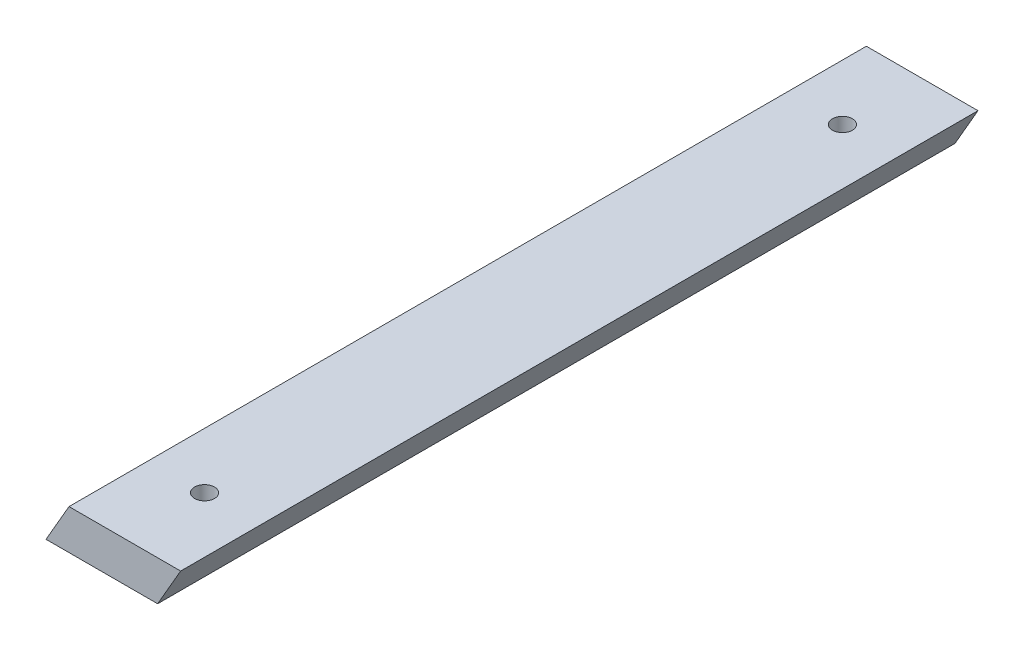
ISO-10303-21;
HEADER;
FILE_DESCRIPTION(('STEP AP214'),'2;1');
FILE_NAME('part.step','',(''),(''),'','','');
FILE_SCHEMA(('AUTOMOTIVE_DESIGN { 1 0 10303 214 1 1 1 1 }'));
ENDSEC;
DATA;
#1=APPLICATION_CONTEXT('core data for automotive mechanical design processes');
#2=APPLICATION_PROTOCOL_DEFINITION('international standard','automotive_design',2000,#1);
#3=PRODUCT_CONTEXT('',#1,'mechanical');
#4=PRODUCT('Part','Part','',(#3));
#5=PRODUCT_RELATED_PRODUCT_CATEGORY('part','',(#4));
#6=PRODUCT_DEFINITION_FORMATION('','',#4);
#7=PRODUCT_DEFINITION_CONTEXT('part definition',#1,'design');
#8=PRODUCT_DEFINITION('design','',#6,#7);
#9=PRODUCT_DEFINITION_SHAPE('','',#8);
#10=(LENGTH_UNIT() NAMED_UNIT(*) SI_UNIT(.MILLI.,.METRE.));
#11=(NAMED_UNIT(*) PLANE_ANGLE_UNIT() SI_UNIT($,.RADIAN.));
#12=(NAMED_UNIT(*) SI_UNIT($,.STERADIAN.) SOLID_ANGLE_UNIT());
#13=UNCERTAINTY_MEASURE_WITH_UNIT(LENGTH_MEASURE(1.E-05),#10,'distance_accuracy_value','');
#14=(GEOMETRIC_REPRESENTATION_CONTEXT(3) GLOBAL_UNCERTAINTY_ASSIGNED_CONTEXT((#13)) GLOBAL_UNIT_ASSIGNED_CONTEXT((#10,
#11,#12)) REPRESENTATION_CONTEXT('',''));
#15=CARTESIAN_POINT('',(0.,0.,0.));
#16=DIRECTION('',(0.,0.,1.));
#17=DIRECTION('',(1.,0.,0.));
#18=AXIS2_PLACEMENT_3D('',#15,#16,#17);
#19=CARTESIAN_POINT('',(0.,-5.,100.));
#20=DIRECTION('',(0.,1.,0.));
#21=DIRECTION('',(0.,0.,1.));
#22=AXIS2_PLACEMENT_3D('',#19,#20,#21);
#23=PLANE('',#22);
#24=DIRECTION('',(1.,0.,0.));
#25=VECTOR('',#24,1.);
#26=CARTESIAN_POINT('',(0.,-5.,-100.));
#27=LINE('',#26,#25);
#28=CARTESIAN_POINT('',(-19.7735026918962,-5.,-100.));
#29=VERTEX_POINT('',#28);
#30=CARTESIAN_POINT('',(8.22649730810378,-5.,-100.));
#31=VERTEX_POINT('',#30);
#32=EDGE_CURVE('E88',#29,#31,#27,.T.);
#33=ORIENTED_EDGE('',*,*,#32,.T.);
#34=DIRECTION('',(0.,0.,-1.));
#35=VECTOR('',#34,1.);
#36=CARTESIAN_POINT('',(8.22649730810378,-5.,100.));
#37=LINE('',#36,#35);
#38=CARTESIAN_POINT('',(8.22649730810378,-5.,100.));
#39=VERTEX_POINT('',#38);
#40=EDGE_CURVE('E44',#39,#31,#37,.T.);
#41=ORIENTED_EDGE('',*,*,#40,.F.);
#42=DIRECTION('',(1.,0.,0.));
#43=VECTOR('',#42,1.);
#44=CARTESIAN_POINT('',(0.,-5.,100.));
#45=LINE('',#44,#43);
#46=CARTESIAN_POINT('',(-19.7735026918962,-5.,100.));
#47=VERTEX_POINT('',#46);
#48=EDGE_CURVE('E78',#47,#39,#45,.T.);
#49=ORIENTED_EDGE('',*,*,#48,.F.);
#50=DIRECTION('',(0.,0.,-1.));
#51=VECTOR('',#50,1.);
#52=CARTESIAN_POINT('',(-19.7735026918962,-5.,100.));
#53=LINE('',#52,#51);
#54=EDGE_CURVE('E11',#47,#29,#53,.T.);
#55=ORIENTED_EDGE('',*,*,#54,.T.);
#56=EDGE_LOOP('',(#33,#41,#49,#55));
#57=FACE_BOUND('',#56,.T.);
#58=CARTESIAN_POINT('',(0.,-5.,80.));
#59=DIRECTION('',(0.,1.,0.));
#60=DIRECTION('',(-1.,0.,0.));
#61=AXIS2_PLACEMENT_3D('',#58,#59,#60);
#62=CIRCLE('',#61,2.5);
#63=CARTESIAN_POINT('',(-2.5,-5.,80.));
#64=VERTEX_POINT('',#63);
#65=EDGE_CURVE('E101',#64,#64,#62,.T.);
#66=ORIENTED_EDGE('',*,*,#65,.T.);
#67=EDGE_LOOP('',(#66));
#68=FACE_BOUND('',#67,.T.);
#69=CARTESIAN_POINT('',(0.,-5.00000000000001,-80.));
#70=DIRECTION('',(0.,-1.,0.));
#71=DIRECTION('',(-1.,0.,0.));
#72=AXIS2_PLACEMENT_3D('',#69,#70,#71);
#73=CIRCLE('',#72,2.5);
#74=CARTESIAN_POINT('',(-2.5,-5.00000000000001,-80.));
#75=VERTEX_POINT('',#74);
#76=EDGE_CURVE('E190',#75,#75,#73,.T.);
#77=ORIENTED_EDGE('',*,*,#76,.F.);
#78=EDGE_LOOP('',(#77));
#79=FACE_BOUND('',#78,.T.);
#80=ADVANCED_FACE('F35',(#57,#68,#79),#23,.F.);
#81=CARTESIAN_POINT('',(0.,5.,100.));
#82=DIRECTION('',(0.,-1.,0.));
#83=DIRECTION('',(1.,0.,0.));
#84=AXIS2_PLACEMENT_3D('',#81,#82,#83);
#85=PLANE('',#84);
#86=DIRECTION('',(-1.,0.,0.));
#87=VECTOR('',#86,1.);
#88=CARTESIAN_POINT('',(0.,5.,-100.));
#89=LINE('',#88,#87);
#90=CARTESIAN_POINT('',(14.,5.,-100.));
#91=VERTEX_POINT('',#90);
#92=CARTESIAN_POINT('',(-14.,5.,-100.));
#93=VERTEX_POINT('',#92);
#94=EDGE_CURVE('E71',#91,#93,#89,.T.);
#95=ORIENTED_EDGE('',*,*,#94,.T.);
#96=DIRECTION('',(0.,0.,-1.));
#97=VECTOR('',#96,1.);
#98=CARTESIAN_POINT('',(-14.,5.,100.));
#99=LINE('',#98,#97);
#100=CARTESIAN_POINT('',(-14.,5.,100.));
#101=VERTEX_POINT('',#100);
#102=EDGE_CURVE('E94',#101,#93,#99,.T.);
#103=ORIENTED_EDGE('',*,*,#102,.F.);
#104=DIRECTION('',(-1.,0.,0.));
#105=VECTOR('',#104,1.);
#106=CARTESIAN_POINT('',(0.,5.,100.));
#107=LINE('',#106,#105);
#108=CARTESIAN_POINT('',(14.,5.,100.));
#109=VERTEX_POINT('',#108);
#110=EDGE_CURVE('E52',#109,#101,#107,.T.);
#111=ORIENTED_EDGE('',*,*,#110,.F.);
#112=DIRECTION('',(0.,0.,-1.));
#113=VECTOR('',#112,1.);
#114=CARTESIAN_POINT('',(14.,5.,100.));
#115=LINE('',#114,#113);
#116=EDGE_CURVE('E68',#109,#91,#115,.T.);
#117=ORIENTED_EDGE('',*,*,#116,.T.);
#118=EDGE_LOOP('',(#95,#103,#111,#117));
#119=FACE_BOUND('',#118,.T.);
#120=CARTESIAN_POINT('',(0.,5.,80.));
#121=DIRECTION('',(0.,1.,0.));
#122=DIRECTION('',(-1.,0.,0.));
#123=AXIS2_PLACEMENT_3D('',#120,#121,#122);
#124=CIRCLE('',#123,2.5);
#125=CARTESIAN_POINT('',(-2.5,5.,80.));
#126=VERTEX_POINT('',#125);
#127=EDGE_CURVE('E196',#126,#126,#124,.T.);
#128=ORIENTED_EDGE('',*,*,#127,.F.);
#129=EDGE_LOOP('',(#128));
#130=FACE_BOUND('',#129,.T.);
#131=CARTESIAN_POINT('',(0.,5.,-80.));
#132=DIRECTION('',(0.,-1.,0.));
#133=DIRECTION('',(-1.,0.,0.));
#134=AXIS2_PLACEMENT_3D('',#131,#132,#133);
#135=CIRCLE('',#134,2.5);
#136=CARTESIAN_POINT('',(-2.5,5.,-80.));
#137=VERTEX_POINT('',#136);
#138=EDGE_CURVE('E193',#137,#137,#135,.T.);
#139=ORIENTED_EDGE('',*,*,#138,.T.);
#140=EDGE_LOOP('',(#139));
#141=FACE_BOUND('',#140,.T.);
#142=ADVANCED_FACE('F124',(#119,#130,#141),#85,.F.);
#143=CARTESIAN_POINT('',(-12.6650635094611,7.31217782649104,100.));
#144=DIRECTION('',(0.86602540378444,-0.499999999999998,0.));
#145=DIRECTION('',(0.499999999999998,0.86602540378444,0.));
#146=AXIS2_PLACEMENT_3D('',#143,#144,#145);
#147=PLANE('',#146);
#148=DIRECTION('',(-0.499999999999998,-0.86602540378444,0.));
#149=VECTOR('',#148,1.);
#150=CARTESIAN_POINT('',(-12.6650635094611,7.31217782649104,-100.));
#151=LINE('',#150,#149);
#152=EDGE_CURVE('E98',#93,#29,#151,.T.);
#153=ORIENTED_EDGE('',*,*,#152,.T.);
#154=ORIENTED_EDGE('',*,*,#54,.F.);
#155=DIRECTION('',(-0.499999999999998,-0.86602540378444,0.));
#156=VECTOR('',#155,1.);
#157=CARTESIAN_POINT('',(-12.6650635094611,7.31217782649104,100.));
#158=LINE('',#157,#156);
#159=EDGE_CURVE('E83',#101,#47,#158,.T.);
#160=ORIENTED_EDGE('',*,*,#159,.F.);
#161=ORIENTED_EDGE('',*,*,#102,.T.);
#162=EDGE_LOOP('',(#153,#154,#160,#161));
#163=FACE_BOUND('',#162,.T.);
#164=ADVANCED_FACE('F37',(#163),#147,.F.);
#165=CARTESIAN_POINT('',(8.33493649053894,-4.81217782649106,100.));
#166=DIRECTION('',(0.86602540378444,-0.499999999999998,0.));
#167=DIRECTION('',(0.499999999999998,0.86602540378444,0.));
#168=AXIS2_PLACEMENT_3D('',#165,#166,#167);
#169=PLANE('',#168);
#170=DIRECTION('',(-0.499999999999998,-0.86602540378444,0.));
#171=VECTOR('',#170,1.);
#172=CARTESIAN_POINT('',(8.33493649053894,-4.81217782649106,-100.));
#173=LINE('',#172,#171);
#174=EDGE_CURVE('E103',#91,#31,#173,.T.);
#175=ORIENTED_EDGE('',*,*,#174,.F.);
#176=ORIENTED_EDGE('',*,*,#116,.F.);
#177=DIRECTION('',(-0.499999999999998,-0.86602540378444,0.));
#178=VECTOR('',#177,1.);
#179=CARTESIAN_POINT('',(8.33493649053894,-4.81217782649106,100.));
#180=LINE('',#179,#178);
#181=EDGE_CURVE('E81',#109,#39,#180,.T.);
#182=ORIENTED_EDGE('',*,*,#181,.T.);
#183=ORIENTED_EDGE('',*,*,#40,.T.);
#184=EDGE_LOOP('',(#175,#176,#182,#183));
#185=FACE_BOUND('',#184,.T.);
#186=ADVANCED_FACE('F92',(#185),#169,.T.);
#187=CARTESIAN_POINT('',(0.,0.,100.));
#188=DIRECTION('',(0.,0.,1.));
#189=DIRECTION('',(1.,0.,0.));
#190=AXIS2_PLACEMENT_3D('',#187,#188,#189);
#191=PLANE('',#190);
#192=ORIENTED_EDGE('',*,*,#159,.T.);
#193=ORIENTED_EDGE('',*,*,#48,.T.);
#194=ORIENTED_EDGE('',*,*,#181,.F.);
#195=ORIENTED_EDGE('',*,*,#110,.T.);
#196=EDGE_LOOP('',(#192,#193,#194,#195));
#197=FACE_BOUND('',#196,.T.);
#198=ADVANCED_FACE('F79',(#197),#191,.T.);
#199=CARTESIAN_POINT('',(0.,0.,-100.));
#200=DIRECTION('',(0.,0.,1.));
#201=DIRECTION('',(1.,0.,0.));
#202=AXIS2_PLACEMENT_3D('',#199,#200,#201);
#203=PLANE('',#202);
#204=ORIENTED_EDGE('',*,*,#152,.F.);
#205=ORIENTED_EDGE('',*,*,#94,.F.);
#206=ORIENTED_EDGE('',*,*,#174,.T.);
#207=ORIENTED_EDGE('',*,*,#32,.F.);
#208=EDGE_LOOP('',(#204,#205,#206,#207));
#209=FACE_BOUND('',#208,.T.);
#210=ADVANCED_FACE('F110',(#209),#203,.F.);
#211=CARTESIAN_POINT('',(0.,-5.,80.));
#212=DIRECTION('',(0.,1.,0.));
#213=DIRECTION('',(-1.,0.,0.));
#214=AXIS2_PLACEMENT_3D('',#211,#212,#213);
#215=CYLINDRICAL_SURFACE('',#214,2.5);
#216=ORIENTED_EDGE('',*,*,#65,.F.);
#217=EDGE_LOOP('',(#216));
#218=FACE_BOUND('',#217,.T.);
#219=ORIENTED_EDGE('',*,*,#127,.T.);
#220=EDGE_LOOP('',(#219));
#221=FACE_BOUND('',#220,.T.);
#222=ADVANCED_FACE('F112',(#218,#221),#215,.F.);
#223=CARTESIAN_POINT('',(0.,-5.00000000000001,-80.));
#224=DIRECTION('',(0.,1.,0.));
#225=DIRECTION('',(-1.,0.,0.));
#226=AXIS2_PLACEMENT_3D('',#223,#224,#225);
#227=CYLINDRICAL_SURFACE('',#226,2.5);
#228=ORIENTED_EDGE('',*,*,#76,.T.);
#229=EDGE_LOOP('',(#228));
#230=FACE_BOUND('',#229,.T.);
#231=ORIENTED_EDGE('',*,*,#138,.F.);
#232=EDGE_LOOP('',(#231));
#233=FACE_BOUND('',#232,.T.);
#234=ADVANCED_FACE('F118',(#230,#233),#227,.F.);
#235=CLOSED_SHELL('',(#80,#142,#164,#186,#198,#210,#222,#234));
#236=MANIFOLD_SOLID_BREP('B2',#235);
#237=ADVANCED_BREP_SHAPE_REPRESENTATION('',(#18,#236),#14);
#238=SHAPE_DEFINITION_REPRESENTATION(#9,#237);
ENDSEC;
END-ISO-10303-21;
